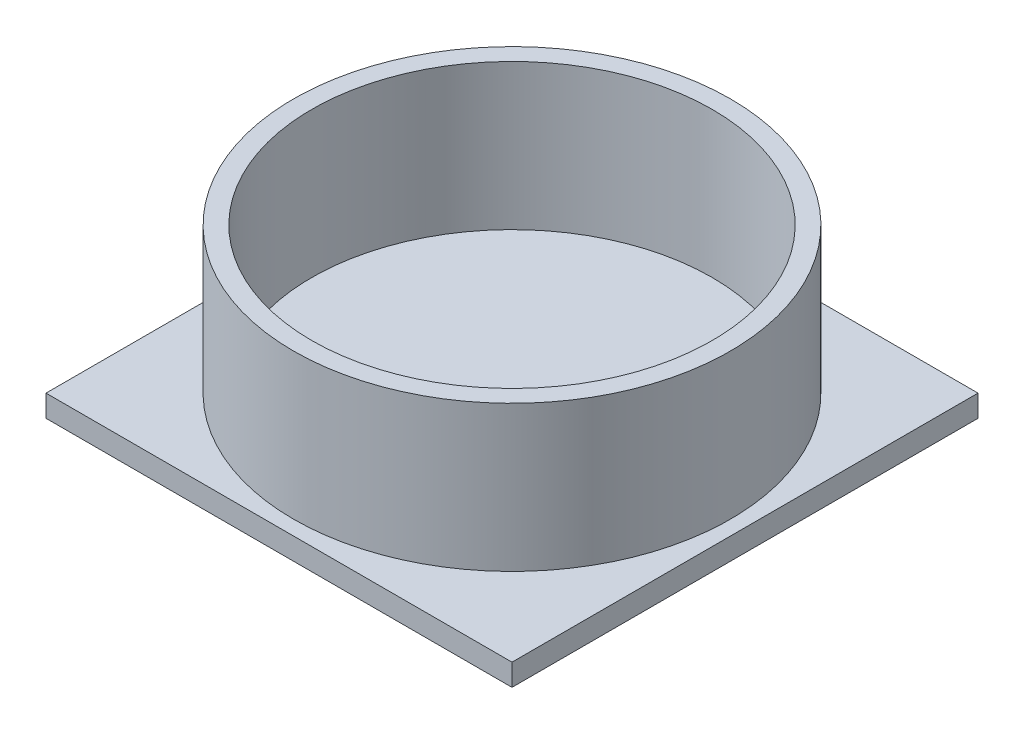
from build123d import *

# Parameters (mm, degrees)
SKETCH1_R           = 300
SKETCH1_R_2         = 275
BOSS_EXTRUDE1_DEPTH = 200
SKETCH2_W           = 640
SKETCH2_H           = 640
BOSS_EXTRUDE2_DEPTH = 30


with BuildPart() as part:
    # Sketch1 → Boss-Extrude1 (new body)
    with BuildSketch(Plane(origin=(0, 0, 0), x_dir=(1, 0, 0), z_dir=(0, 1, 0))):
        with Locations(Location((0, 0, 0), (0, 0, 270))):
            Circle(SKETCH1_R)
        with Locations(Location((0, 0, 0), (0, 0, 270))):
            Circle(SKETCH1_R_2, mode=Mode.SUBTRACT)
    extrude(amount=BOSS_EXTRUDE1_DEPTH)

    # Sketch2 → Boss-Extrude2 (add)
    with BuildSketch(Plane(origin=(0, 0, 0), x_dir=(1, 0, 0), z_dir=(0, 1, 0))):
        Rectangle(SKETCH2_W, SKETCH2_H)
    extrude(amount=-BOSS_EXTRUDE2_DEPTH)


solid = part.part
